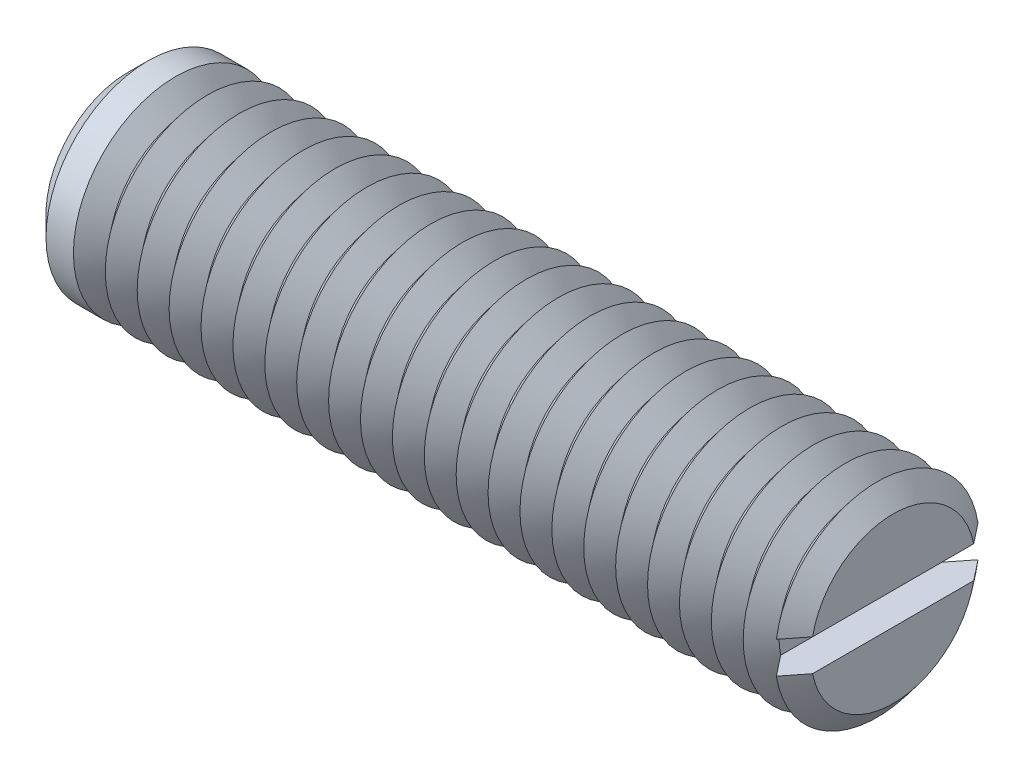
from build123d import *

# Parameters (mm, degrees)
SKETCH1_R       = 4
EXTRUDE1_DEPTH  = 15
SKETCH2_W       = 1.25
SKETCH2_H       = 1.25
EXTRUDE2_DEPTH  = 6
CHAMFER1_SIZE   = 0.8
LPATTERN1_COUNT = 23
LPATTERN1_PITCH = 1.25


with BuildPart() as part:
    # Sketch1 → Extrude1 (new, symmetric)
    with BuildSketch(Plane(origin=(0, 0, 0), x_dir=(0, 0, -1), z_dir=(1, 0, 0))):
        Circle(SKETCH1_R)
    extrude(amount=EXTRUDE1_DEPTH, both=True)

    # Sketch2 → Extrude2 (cut, symmetric)
    with BuildSketch(Plane.XY):
        with Locations((14.375, 0)):
            Rectangle(SKETCH2_W, SKETCH2_H)
    extrude(amount=EXTRUDE2_DEPTH, both=True, mode=Mode.SUBTRACT)

    # Chamfer1
    chamfer1_edges = [part.edges().sort_by_distance(p)[0] for p in [
        (-15, 0, 4),
    ]]
    chamfer(chamfer1_edges, length=CHAMFER1_SIZE)

    # Sketch3 → Cut-Revolve1 (revolve, cut)
    with BuildSketch(Plane.XY, mode=Mode.PRIVATE) as cut_revolve1_sk:
        Polygon((14.375, -4), (15.625, -4), (15, -3.21937525), align=None)
    cut_revolve1 = revolve(cut_revolve1_sk.sketch.rotate(Axis((0, 0, 0), (1, 0, 0)), 278.989299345), axis=Axis((0, 0, 0), (1, 0, 0)), mode=Mode.SUBTRACT)

    # LPattern1: Cut-Revolve1 ×23
    with Locations(*[(-i * LPATTERN1_PITCH, 0, 0) for i in range(1, LPATTERN1_COUNT)]):
        add(cut_revolve1, mode=Mode.SUBTRACT)


solid = part.part
